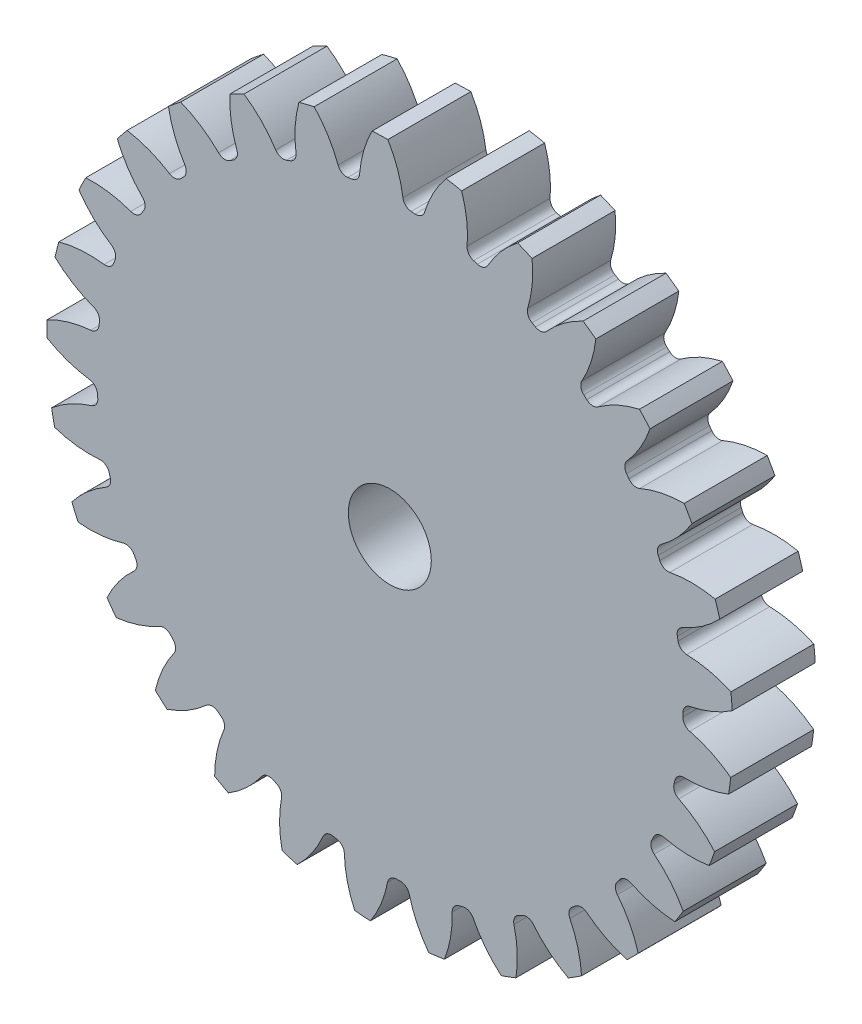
from build123d import *

# Parameters (mm, degrees)
SKETCH3_R         = 524.933333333
GEARBODY_DEPTH    = 127
TOOTHCUT_DEPTH    = 754.15271286
CIRPATTERN1_COUNT = 29
BOREDIA_R         = 63.5
BORE_DEPTH        = 12700


with BuildPart() as part:
    # Sketch3 → gearBody (new body)
    with BuildSketch(Plane.XY):
        Circle(SKETCH3_R)
    extrude(amount=GEARBODY_DEPTH)

    # Sketch2 → toothCut (cut, through all)
    with BuildSketch(Plane.XY):
        with BuildLine():
            ThreePointArc((448.498506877, -14.515294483), (448.586772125, -11.467882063), (448.654331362, -8.419940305))
            ThreePointArc((448.654331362, -8.419940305), (451.88025561, 0.185690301), (459.798732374, 4.850579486))
            ThreePointArc((459.798732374, 4.850579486), (493.751930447, 15.132323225), (524.933333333, 32.051366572))
            ThreePointArc((524.933333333, 32.051366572), (525.739150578, -13.440241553), (522.609967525, -58.83125349))
            ThreePointArc((522.609967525, -58.83125349), (492.33378243, -40.341079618), (458.950286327, -28.337909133))
            ThreePointArc((458.950286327, -28.337909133), (451.280507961, -23.274514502), (448.498506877, -14.515294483))
        make_face()
    toothcut = extrude(amount=TOOTHCUT_DEPTH, mode=Mode.SUBTRACT)

    # CirPattern1: toothCut ×29 about axis
    cirpattern1_axis = Axis((0, 0, 0), (0, 0, 1))
    for i in range(1, CIRPATTERN1_COUNT):
        add(toothcut.rotate(cirpattern1_axis, i * 360 / CIRPATTERN1_COUNT), mode=Mode.SUBTRACT)

    # boreDia → bore (cut, symmetric)
    with BuildSketch(Plane.XY):
        Circle(BOREDIA_R)
    extrude(amount=BORE_DEPTH, both=True, mode=Mode.SUBTRACT)


solid = part.part
